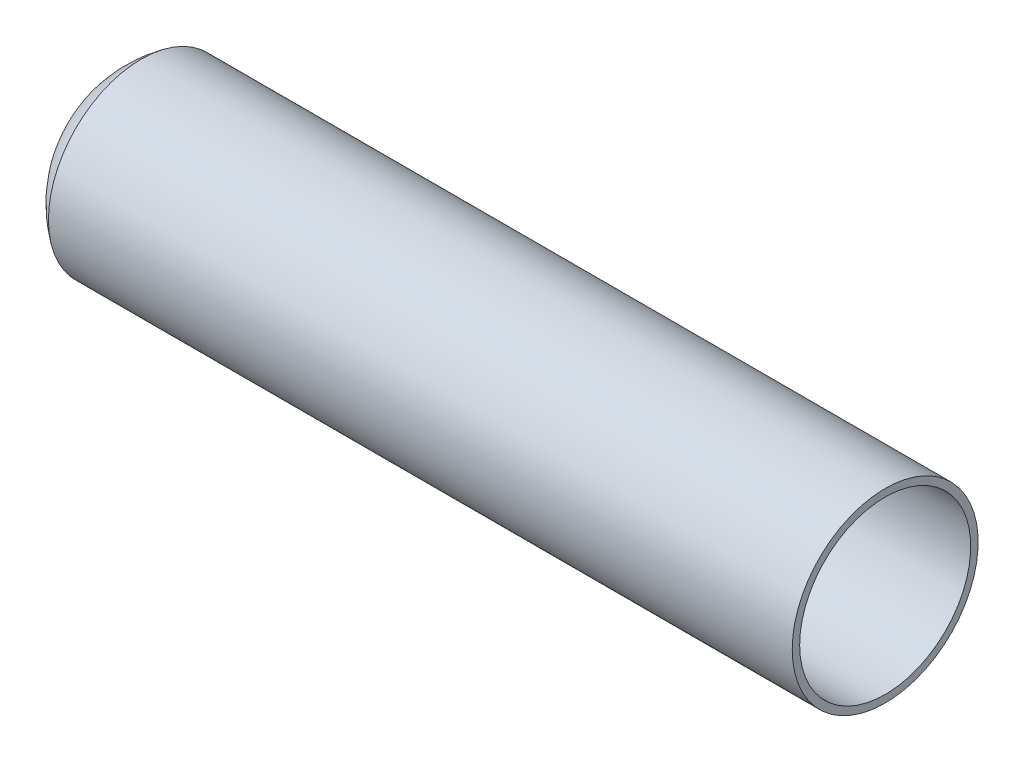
ISO-10303-21;
HEADER;
FILE_DESCRIPTION(('STEP AP214'),'2;1');
FILE_NAME('part.step','',(''),(''),'','','');
FILE_SCHEMA(('AUTOMOTIVE_DESIGN { 1 0 10303 214 1 1 1 1 }'));
ENDSEC;
DATA;
#1=APPLICATION_CONTEXT('core data for automotive mechanical design processes');
#2=APPLICATION_PROTOCOL_DEFINITION('international standard','automotive_design',2000,#1);
#3=PRODUCT_CONTEXT('',#1,'mechanical');
#4=PRODUCT('Part','Part','',(#3));
#5=PRODUCT_RELATED_PRODUCT_CATEGORY('part','',(#4));
#6=PRODUCT_DEFINITION_FORMATION('','',#4);
#7=PRODUCT_DEFINITION_CONTEXT('part definition',#1,'design');
#8=PRODUCT_DEFINITION('design','',#6,#7);
#9=PRODUCT_DEFINITION_SHAPE('','',#8);
#10=(LENGTH_UNIT() NAMED_UNIT(*) SI_UNIT(.MILLI.,.METRE.));
#11=(NAMED_UNIT(*) PLANE_ANGLE_UNIT() SI_UNIT($,.RADIAN.));
#12=(NAMED_UNIT(*) SI_UNIT($,.STERADIAN.) SOLID_ANGLE_UNIT());
#13=UNCERTAINTY_MEASURE_WITH_UNIT(LENGTH_MEASURE(1.E-05),#10,'distance_accuracy_value','');
#14=(GEOMETRIC_REPRESENTATION_CONTEXT(3) GLOBAL_UNCERTAINTY_ASSIGNED_CONTEXT((#13)) GLOBAL_UNIT_ASSIGNED_CONTEXT((#10,
#11,#12)) REPRESENTATION_CONTEXT('',''));
#15=CARTESIAN_POINT('',(0.,0.,0.));
#16=DIRECTION('',(0.,0.,1.));
#17=DIRECTION('',(1.,0.,0.));
#18=AXIS2_PLACEMENT_3D('',#15,#16,#17);
#19=CARTESIAN_POINT('',(14.2,0.,0.));
#20=DIRECTION('',(-1.,0.,0.));
#21=DIRECTION('',(0.,0.,1.));
#22=AXIS2_PLACEMENT_3D('',#19,#20,#21);
#23=CYLINDRICAL_SURFACE('',#22,23.);
#24=CARTESIAN_POINT('',(225.2,0.,0.));
#25=DIRECTION('',(-1.,0.,0.));
#26=DIRECTION('',(0.,0.,1.));
#27=AXIS2_PLACEMENT_3D('',#24,#25,#26);
#28=CIRCLE('',#27,23.);
#29=CARTESIAN_POINT('',(225.2,0.,23.));
#30=VERTEX_POINT('',#29);
#31=EDGE_CURVE('E54',#30,#30,#28,.T.);
#32=ORIENTED_EDGE('',*,*,#31,.F.);
#33=EDGE_LOOP('',(#32));
#34=FACE_BOUND('',#33,.T.);
#35=CARTESIAN_POINT('',(25.8395036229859,0.,0.));
#36=DIRECTION('',(-1.,0.,0.));
#37=DIRECTION('',(0.,0.,1.));
#38=AXIS2_PLACEMENT_3D('',#35,#36,#37);
#39=CIRCLE('',#38,23.);
#40=CARTESIAN_POINT('',(25.8395036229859,23.,0.));
#41=VERTEX_POINT('',#40);
#42=EDGE_CURVE('E10',#41,#41,#39,.T.);
#43=ORIENTED_EDGE('',*,*,#42,.T.);
#44=EDGE_LOOP('',(#43));
#45=FACE_BOUND('',#44,.T.);
#46=ADVANCED_FACE('F32',(#34,#45),#23,.F.);
#47=CARTESIAN_POINT('',(42.6090909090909,0.,0.));
#48=DIRECTION('',(-1.,0.,0.));
#49=DIRECTION('',(0.,1.,0.));
#50=AXIS2_PLACEMENT_3D('',#47,#48,#49);
#51=SPHERICAL_SURFACE('',#50,28.464347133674);
#52=CARTESIAN_POINT('',(16.2,0.,0.));
#53=DIRECTION('',(-1.,0.,0.));
#54=DIRECTION('',(0.,0.,1.));
#55=AXIS2_PLACEMENT_3D('',#52,#53,#54);
#56=CIRCLE('',#55,10.6197445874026);
#57=CARTESIAN_POINT('',(16.2,10.6197445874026,0.));
#58=VERTEX_POINT('',#57);
#59=EDGE_CURVE('E38',#58,#58,#56,.T.);
#60=CARTESIAN_POINT('',(25.8395036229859,23.,0.));
#61=CARTESIAN_POINT('',(25.7057055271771,22.9024463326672,0.));
#62=CARTESIAN_POINT('',(25.5727588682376,22.8037249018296,0.));
#63=CARTESIAN_POINT('',(25.3086084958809,22.6039771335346,0.));
#64=CARTESIAN_POINT('',(25.1774047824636,22.5029507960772,0.));
#65=CARTESIAN_POINT('',(24.9167803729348,22.2986238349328,0.));
#66=CARTESIAN_POINT('',(24.7873596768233,22.1953232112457,0.));
#67=CARTESIAN_POINT('',(24.5303406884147,21.9864791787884,0.));
#68=CARTESIAN_POINT('',(24.4027423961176,21.8809357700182,0.));
#69=CARTESIAN_POINT('',(24.1494070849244,21.6676383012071,0.));
#70=CARTESIAN_POINT('',(24.0236700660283,21.5598842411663,0.));
#71=CARTESIAN_POINT('',(23.7740955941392,21.3421982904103,0.));
#72=CARTESIAN_POINT('',(23.6502581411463,21.2322663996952,0.));
#73=CARTESIAN_POINT('',(23.4045205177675,21.0102582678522,0.));
#74=CARTESIAN_POINT('',(23.2826203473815,20.8981820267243,0.));
#75=CARTESIAN_POINT('',(23.0407944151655,20.6719193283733,0.));
#76=CARTESIAN_POINT('',(22.9208686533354,20.5577328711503,0.));
#77=CARTESIAN_POINT('',(22.6830280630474,20.3272845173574,0.));
#78=CARTESIAN_POINT('',(22.5651132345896,20.2110226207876,0.));
#79=CARTESIAN_POINT('',(22.3313304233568,19.9764587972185,0.));
#80=CARTESIAN_POINT('',(22.2154624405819,19.8581568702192,0.));
#81=CARTESIAN_POINT('',(21.9858086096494,19.6195490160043,0.));
#82=CARTESIAN_POINT('',(21.8720227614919,19.4992430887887,0.));
#83=CARTESIAN_POINT('',(21.6465678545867,19.2566638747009,0.));
#84=CARTESIAN_POINT('',(21.5348987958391,19.1343905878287,0.));
#85=CARTESIAN_POINT('',(21.3137114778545,18.8879138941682,0.));
#86=CARTESIAN_POINT('',(21.2041932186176,18.7637104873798,0.));
#87=CARTESIAN_POINT('',(20.9873408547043,18.513411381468,0.));
#88=CARTESIAN_POINT('',(20.8800067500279,18.3873156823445,0.));
#89=CARTESIAN_POINT('',(20.667555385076,18.133270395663,0.));
#90=CARTESIAN_POINT('',(20.5624381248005,18.0053208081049,0.));
#91=CARTESIAN_POINT('',(20.3544524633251,17.7476067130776,0.));
#92=CARTESIAN_POINT('',(20.2515840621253,17.6178422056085,0.));
#93=CARTESIAN_POINT('',(20.0481274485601,17.3565377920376,0.));
#94=CARTESIAN_POINT('',(19.9475392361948,17.2249978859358,0.));
#95=CARTESIAN_POINT('',(19.7486736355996,16.9601827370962,0.));
#96=CARTESIAN_POINT('',(19.6503962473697,16.8269074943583,0.));
#97=CARTESIAN_POINT('',(19.4561822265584,16.5586622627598,0.));
#98=CARTESIAN_POINT('',(19.3602455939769,16.4236922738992,0.));
#99=CARTESIAN_POINT('',(19.1707423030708,16.152098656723,0.));
#100=CARTESIAN_POINT('',(19.0771756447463,16.0154750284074,0.));
#101=CARTESIAN_POINT('',(18.89244079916,15.7406157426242,0.));
#102=CARTESIAN_POINT('',(18.8012726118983,15.6023800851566,0.));
#103=CARTESIAN_POINT('',(18.6213624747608,15.3243388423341,0.));
#104=CARTESIAN_POINT('',(18.5326205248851,15.1845332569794,0.));
#105=CARTESIAN_POINT('',(18.357589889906,14.9033947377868,0.));
#106=CARTESIAN_POINT('',(18.2713012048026,14.762061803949,0.));
#107=CARTESIAN_POINT('',(18.1012033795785,14.4779116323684,0.));
#108=CARTESIAN_POINT('',(18.0173942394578,14.3350943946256,0.));
#109=CARTESIAN_POINT('',(17.8522810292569,14.0480191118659,0.));
#110=CARTESIAN_POINT('',(17.7709769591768,13.9037610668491,0.));
#111=CARTESIAN_POINT('',(17.6108986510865,13.6138481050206,0.));
#112=CARTESIAN_POINT('',(17.5321244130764,13.4681931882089,0.));
#113=CARTESIAN_POINT('',(17.3771297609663,13.1755308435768,0.));
#114=CARTESIAN_POINT('',(17.3009093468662,13.0285234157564,0.));
#115=CARTESIAN_POINT('',(17.1510455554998,12.7332008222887,0.));
#116=CARTESIAN_POINT('',(17.0774021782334,12.5848856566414,0.));
#117=CARTESIAN_POINT('',(16.9327148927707,12.2869927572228,0.));
#118=CARTESIAN_POINT('',(16.8616709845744,12.1374150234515,0.));
#119=CARTESIAN_POINT('',(16.7222042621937,11.8370425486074,0.));
#120=CARTESIAN_POINT('',(16.6537814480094,11.6862478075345,0.));
#121=CARTESIAN_POINT('',(16.5195777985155,11.3834872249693,0.));
#122=CARTESIAN_POINT('',(16.4537969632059,11.2315213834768,0.));
#123=CARTESIAN_POINT('',(16.3248971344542,10.9264649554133,0.));
#124=CARTESIAN_POINT('',(16.2617781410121,10.7733743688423,0.));
#125=CARTESIAN_POINT('',(16.2,10.6197445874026,0.));
#126=B_SPLINE_CURVE_WITH_KNOTS('',3,(#60,#61,#62,#63,#64,#65,#66,#67,#68,#69,#70,#71,#72,#73,
#74,#75,#76,#77,#78,#79,#80,#81,#82,#83,#84,#85,#86,#87,#88,#89,#90,#91,#92,#93,#94,#95,#96,#97,
#98,#99,#100,#101,#102,#103,#104,#105,#106,#107,#108,#109,#110,#111,#112,#113,#114,#115,#116,
#117,#118,#119,#120,#121,#122,#123,#124,#125),.UNSPECIFIED.,.F.,.F.,(4,2,2,2,2,2,2,2,2,2,2,2,2,
2,2,2,2,2,2,2,2,2,2,2,2,2,2,2,2,2,2,2,4),(0.,0.496751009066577,0.993502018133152,
1.49025302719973,1.9870040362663,2.48375504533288,2.98050605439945,3.47725706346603,
3.9740080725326,4.47075908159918,4.96751009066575,5.46426109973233,5.9610121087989,
6.45776311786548,6.95451412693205,7.45126513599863,7.9480161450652,8.44476715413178,
8.94151816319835,9.43826917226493,9.9350201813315,10.4317711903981,10.9285221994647,
11.4252732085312,11.9220242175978,12.4187752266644,12.915526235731,13.4122772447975,
13.9090282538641,14.4057792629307,14.9025302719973,15.3992812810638,15.8960322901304),.UNSPECIFIED.);
#127=EDGE_CURVE('BSEAM62',#41,#58,#126,.T.);
#128=ORIENTED_EDGE('',*,*,#42,.F.);
#129=ORIENTED_EDGE('',*,*,#59,.T.);
#130=ORIENTED_EDGE('',*,*,#127,.T.);
#131=ORIENTED_EDGE('',*,*,#127,.F.);
#132=EDGE_LOOP('',(#128,#130,#129,#131));
#133=FACE_BOUND('',#132,.T.);
#134=ADVANCED_FACE('F62',(#133),#51,.F.);
#135=CARTESIAN_POINT('',(16.2,0.,0.));
#136=DIRECTION('',(-1.,0.,0.));
#137=DIRECTION('',(0.,0.,1.));
#138=AXIS2_PLACEMENT_3D('',#135,#136,#137);
#139=PLANE('',#138);
#140=ORIENTED_EDGE('',*,*,#59,.F.);
#141=EDGE_LOOP('',(#140));
#142=FACE_BOUND('',#141,.T.);
#143=ADVANCED_FACE('F66',(#142),#139,.F.);
#144=CARTESIAN_POINT('',(14.2,0.,0.));
#145=DIRECTION('',(-1.,0.,0.));
#146=DIRECTION('',(0.,0.,1.));
#147=AXIS2_PLACEMENT_3D('',#144,#145,#146);
#148=PLANE('',#147);
#149=CARTESIAN_POINT('',(14.2,0.,0.));
#150=DIRECTION('',(-1.,0.,0.));
#151=DIRECTION('',(0.,0.,1.));
#152=AXIS2_PLACEMENT_3D('',#149,#150,#151);
#153=CIRCLE('',#152,11.);
#154=CARTESIAN_POINT('',(14.2,11.,0.));
#155=VERTEX_POINT('',#154);
#156=EDGE_CURVE('E42',#155,#155,#153,.T.);
#157=ORIENTED_EDGE('',*,*,#156,.T.);
#158=EDGE_LOOP('',(#157));
#159=FACE_BOUND('',#158,.T.);
#160=ADVANCED_FACE('F71',(#159),#148,.T.);
#161=CARTESIAN_POINT('',(42.6090909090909,0.,0.));
#162=DIRECTION('',(-1.,0.,0.));
#163=DIRECTION('',(0.,1.,0.));
#164=AXIS2_PLACEMENT_3D('',#161,#162,#163);
#165=SPHERICAL_SURFACE('',#164,30.464347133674);
#166=CARTESIAN_POINT('',(25.2,0.,0.));
#167=DIRECTION('',(-1.,0.,0.));
#168=DIRECTION('',(0.,0.,1.));
#169=AXIS2_PLACEMENT_3D('',#166,#167,#168);
#170=CIRCLE('',#169,25.);
#171=CARTESIAN_POINT('',(25.2,25.,0.));
#172=VERTEX_POINT('',#171);
#173=EDGE_CURVE('E46',#172,#172,#170,.T.);
#174=CARTESIAN_POINT('',(25.2,25.,0.));
#175=CARTESIAN_POINT('',(25.0455489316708,24.8924461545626,0.));
#176=CARTESIAN_POINT('',(24.8920948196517,24.7834606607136,0.));
#177=CARTESIAN_POINT('',(24.5872326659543,24.5626645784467,0.));
#178=CARTESIAN_POINT('',(24.4358246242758,24.4508539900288,0.));
#179=CARTESIAN_POINT('',(24.1351067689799,24.224445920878,0.));
#180=CARTESIAN_POINT('',(23.9857969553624,24.1098484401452,0.));
#181=CARTESIAN_POINT('',(23.6893268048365,23.8779060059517,0.));
#182=CARTESIAN_POINT('',(23.5421664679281,23.7605610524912,0.));
#183=CARTESIAN_POINT('',(23.250045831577,23.5231639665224,0.));
#184=CARTESIAN_POINT('',(23.1050855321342,23.4031118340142,0.));
#185=CARTESIAN_POINT('',(22.8174147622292,23.1603416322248,0.));
#186=CARTESIAN_POINT('',(22.674704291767,23.0376235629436,0.));
#187=CARTESIAN_POINT('',(22.3915822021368,22.7895636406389,0.));
#188=CARTESIAN_POINT('',(22.2511705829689,22.6642217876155,0.));
#189=CARTESIAN_POINT('',(21.9726944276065,22.4109573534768,0.));
#190=CARTESIAN_POINT('',(21.8346298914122,22.2830347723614,0.));
#191=CARTESIAN_POINT('',(21.5608953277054,22.024652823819,0.));
#192=CARTESIAN_POINT('',(21.425225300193,21.8941934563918,0.));
#193=CARTESIAN_POINT('',(21.1563263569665,21.6307827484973,0.));
#194=CARTESIAN_POINT('',(21.0230974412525,21.4978314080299,0.));
#195=CARTESIAN_POINT('',(20.7591264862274,21.2294824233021,0.));
#196=CARTESIAN_POINT('',(20.6283844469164,21.0940847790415,0.));
#197=CARTESIAN_POINT('',(20.3694321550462,20.8208896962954,0.));
#198=CARTESIAN_POINT('',(20.241221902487,20.6830922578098,0.));
#199=CARTESIAN_POINT('',(19.9873772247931,20.4051449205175,0.));
#200=CARTESIAN_POINT('',(19.8617427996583,20.2649950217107,0.));
#201=CARTESIAN_POINT('',(19.6130929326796,19.9823909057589,0.));
#202=CARTESIAN_POINT('',(19.4900774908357,19.8399366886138,0.));
#203=CARTESIAN_POINT('',(19.2467078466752,19.5527728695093,0.));
#204=CARTESIAN_POINT('',(19.1263536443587,19.40806326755,0.));
#205=CARTESIAN_POINT('',(18.8883478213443,19.1164383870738,0.));
#206=CARTESIAN_POINT('',(18.7706962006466,18.969523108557,0.));
#207=CARTESIAN_POINT('',(18.5381359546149,18.6735373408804,0.));
#208=CARTESIAN_POINT('',(18.423227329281,18.5244668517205,0.));
#209=CARTESIAN_POINT('',(18.1961925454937,18.2242218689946,0.));
#210=CARTESIAN_POINT('',(18.0840663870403,18.0730473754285,0.));
#211=CARTESIAN_POINT('',(17.8626350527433,17.7686463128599,0.));
#212=CARTESIAN_POINT('',(17.7533298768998,17.6154197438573,0.));
#213=CARTESIAN_POINT('',(17.5375780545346,17.3069671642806,0.));
#214=CARTESIAN_POINT('',(17.4311314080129,17.1517411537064,0.));
#215=CARTESIAN_POINT('',(17.2211332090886,16.8393430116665,0.));
#216=CARTESIAN_POINT('',(17.117581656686,16.6821708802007,0.));
#217=CARTESIAN_POINT('',(16.9134092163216,16.3659344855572,0.));
#218=CARTESIAN_POINT('',(16.8127883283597,16.2068702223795,0.));
#219=CARTESIAN_POINT('',(16.614511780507,15.8869042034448,0.));
#220=CARTESIAN_POINT('',(16.5168561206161,15.7260024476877,0.));
#221=CARTESIAN_POINT('',(16.3245435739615,15.4024167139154,0.));
#222=CARTESIAN_POINT('',(16.2298866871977,15.2397327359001,0.));
#223=CARTESIAN_POINT('',(16.0436042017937,14.9126384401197,0.));
#224=CARTESIAN_POINT('',(15.9519786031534,14.7482281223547,0.));
#225=CARTESIAN_POINT('',(15.7717901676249,14.4177376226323,0.));
#226=CARTESIAN_POINT('',(15.6832273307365,14.2516574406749,0.));
#227=CARTESIAN_POINT('',(15.5091948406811,13.9178842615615,0.));
#228=CARTESIAN_POINT('',(15.423725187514,13.7501912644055,0.));
#229=CARTESIAN_POINT('',(15.2559084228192,13.4132500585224,0.));
#230=CARTESIAN_POINT('',(15.1735613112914,13.2440018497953,0.));
#231=CARTESIAN_POINT('',(15.0120179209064,12.9040083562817,0.));
#232=CARTESIAN_POINT('',(14.9328216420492,12.7332630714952,0.));
#233=CARTESIAN_POINT('',(14.7776071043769,12.3903340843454,0.));
#234=CARTESIAN_POINT('',(14.7015888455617,12.2181503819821,0.));
#235=CARTESIAN_POINT('',(14.552756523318,11.8724036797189,0.));
#236=CARTESIAN_POINT('',(14.4799424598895,11.6988406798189,0.));
#237=CARTESIAN_POINT('',(14.337543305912,11.3503950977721,0.));
#238=CARTESIAN_POINT('',(14.2679582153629,11.1755125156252,0.));
#239=CARTESIAN_POINT('',(14.2,11.,0.));
#240=B_SPLINE_CURVE_WITH_KNOTS('',3,(#174,#175,#176,#177,#178,#179,#180,#181,#182,#183,#184,
#185,#186,#187,#188,#189,#190,#191,#192,#193,#194,#195,#196,#197,#198,#199,#200,#201,#202,#203,
#204,#205,#206,#207,#208,#209,#210,#211,#212,#213,#214,#215,#216,#217,#218,#219,#220,#221,#222,
#223,#224,#225,#226,#227,#228,#229,#230,#231,#232,#233,#234,#235,#236,#237,#238,#239),
.UNSPECIFIED.,.F.,.F.,(4,2,2,2,2,2,2,2,2,2,2,2,2,2,2,2,2,2,2,2,2,2,2,2,2,2,2,2,2,2,2,2,4),(0.,
0.564621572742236,1.12924314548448,1.69386471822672,2.25848629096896,2.8231078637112,
3.38772943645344,3.95235100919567,4.51697258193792,5.08159415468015,5.64621572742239,
6.21083730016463,6.77545887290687,7.34008044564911,7.90470201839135,8.46932359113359,
9.03394516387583,9.59856673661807,10.1631883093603,10.7278098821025,11.2924314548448,
11.857053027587,12.4216746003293,12.9862961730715,13.5509177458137,14.115539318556,
14.6801608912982,15.2447824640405,15.8094040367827,16.3740256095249,16.9386471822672,
17.5032687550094,18.0678903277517),.UNSPECIFIED.);
#241=EDGE_CURVE('BSEAM77',#172,#155,#240,.T.);
#242=ORIENTED_EDGE('',*,*,#173,.T.);
#243=ORIENTED_EDGE('',*,*,#156,.F.);
#244=ORIENTED_EDGE('',*,*,#241,.T.);
#245=ORIENTED_EDGE('',*,*,#241,.F.);
#246=EDGE_LOOP('',(#242,#244,#243,#245));
#247=FACE_BOUND('',#246,.T.);
#248=ADVANCED_FACE('F77',(#247),#165,.T.);
#249=CARTESIAN_POINT('',(14.2,0.,0.));
#250=DIRECTION('',(-1.,0.,0.));
#251=DIRECTION('',(0.,0.,1.));
#252=AXIS2_PLACEMENT_3D('',#249,#250,#251);
#253=CYLINDRICAL_SURFACE('',#252,25.);
#254=CARTESIAN_POINT('',(225.2,0.,0.));
#255=DIRECTION('',(-1.,0.,0.));
#256=DIRECTION('',(0.,0.,1.));
#257=AXIS2_PLACEMENT_3D('',#254,#255,#256);
#258=CIRCLE('',#257,25.);
#259=CARTESIAN_POINT('',(225.2,0.,25.));
#260=VERTEX_POINT('',#259);
#261=EDGE_CURVE('E51',#260,#260,#258,.T.);
#262=ORIENTED_EDGE('',*,*,#261,.T.);
#263=EDGE_LOOP('',(#262));
#264=FACE_BOUND('',#263,.T.);
#265=ORIENTED_EDGE('',*,*,#173,.F.);
#266=EDGE_LOOP('',(#265));
#267=FACE_BOUND('',#266,.T.);
#268=ADVANCED_FACE('F81',(#264,#267),#253,.T.);
#269=CARTESIAN_POINT('',(225.2,25.,0.));
#270=DIRECTION('',(1.,0.,0.));
#271=DIRECTION('',(0.,0.,-1.));
#272=AXIS2_PLACEMENT_3D('',#269,#270,#271);
#273=PLANE('',#272);
#274=ORIENTED_EDGE('',*,*,#31,.T.);
#275=EDGE_LOOP('',(#274));
#276=FACE_BOUND('',#275,.T.);
#277=ORIENTED_EDGE('',*,*,#261,.F.);
#278=EDGE_LOOP('',(#277));
#279=FACE_BOUND('',#278,.T.);
#280=ADVANCED_FACE('F58',(#276,#279),#273,.T.);
#281=CLOSED_SHELL('',(#46,#134,#143,#160,#248,#268,#280));
#282=MANIFOLD_SOLID_BREP('B2',#281);
#283=ADVANCED_BREP_SHAPE_REPRESENTATION('',(#18,#282),#14);
#284=SHAPE_DEFINITION_REPRESENTATION(#9,#283);
ENDSEC;
END-ISO-10303-21;
